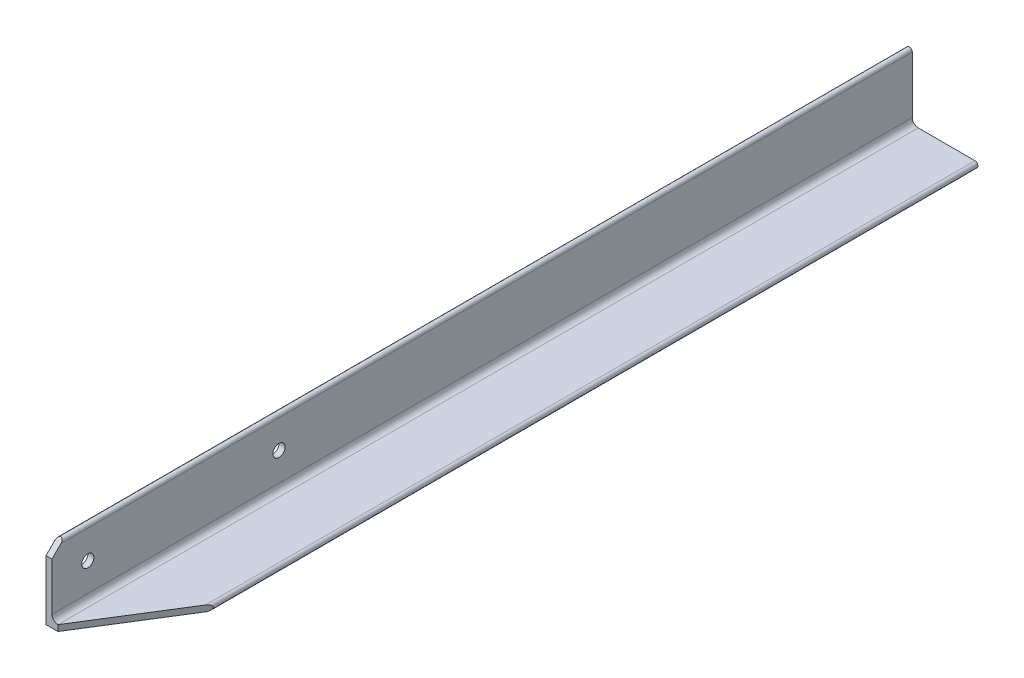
ISO-10303-21;
HEADER;
FILE_DESCRIPTION(('STEP AP214'),'2;1');
FILE_NAME('part.step','',(''),(''),'','','');
FILE_SCHEMA(('AUTOMOTIVE_DESIGN { 1 0 10303 214 1 1 1 1 }'));
ENDSEC;
DATA;
#1=APPLICATION_CONTEXT('core data for automotive mechanical design processes');
#2=APPLICATION_PROTOCOL_DEFINITION('international standard','automotive_design',2000,#1);
#3=PRODUCT_CONTEXT('',#1,'mechanical');
#4=PRODUCT('Part','Part','',(#3));
#5=PRODUCT_RELATED_PRODUCT_CATEGORY('part','',(#4));
#6=PRODUCT_DEFINITION_FORMATION('','',#4);
#7=PRODUCT_DEFINITION_CONTEXT('part definition',#1,'design');
#8=PRODUCT_DEFINITION('design','',#6,#7);
#9=PRODUCT_DEFINITION_SHAPE('','',#8);
#10=(LENGTH_UNIT() NAMED_UNIT(*) SI_UNIT(.MILLI.,.METRE.));
#11=(NAMED_UNIT(*) PLANE_ANGLE_UNIT() SI_UNIT($,.RADIAN.));
#12=(NAMED_UNIT(*) SI_UNIT($,.STERADIAN.) SOLID_ANGLE_UNIT());
#13=UNCERTAINTY_MEASURE_WITH_UNIT(LENGTH_MEASURE(1.E-05),#10,'distance_accuracy_value','');
#14=(GEOMETRIC_REPRESENTATION_CONTEXT(3) GLOBAL_UNCERTAINTY_ASSIGNED_CONTEXT((#13)) GLOBAL_UNIT_ASSIGNED_CONTEXT((#10,
#11,#12)) REPRESENTATION_CONTEXT('',''));
#15=CARTESIAN_POINT('',(0.,0.,0.));
#16=DIRECTION('',(0.,0.,1.));
#17=DIRECTION('',(1.,0.,0.));
#18=AXIS2_PLACEMENT_3D('',#15,#16,#17);
#19=CARTESIAN_POINT('',(0.,0.,228.6));
#20=DIRECTION('',(0.,1.,0.));
#21=DIRECTION('',(-1.,0.,0.));
#22=AXIS2_PLACEMENT_3D('',#19,#20,#21);
#23=PLANE('',#22);
#24=DIRECTION('',(0.,0.,-1.));
#25=VECTOR('',#24,1.);
#26=CARTESIAN_POINT('',(36.5125,0.,228.6));
#27=LINE('',#26,#25);
#28=CARTESIAN_POINT('',(36.5125,0.,180.34));
#29=VERTEX_POINT('',#28);
#30=CARTESIAN_POINT('',(36.5125,0.,-228.6));
#31=VERTEX_POINT('',#30);
#32=EDGE_CURVE('E99',#29,#31,#27,.T.);
#33=ORIENTED_EDGE('',*,*,#32,.F.);
#34=DIRECTION('',(0.52999894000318,0.,-0.847998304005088));
#35=VECTOR('',#34,1.);
#36=CARTESIAN_POINT('',(38.1,0.,177.8));
#37=LINE('',#36,#35);
#38=CARTESIAN_POINT('',(6.35,0.,228.6));
#39=VERTEX_POINT('',#38);
#40=EDGE_CURVE('E167',#39,#29,#37,.T.);
#41=ORIENTED_EDGE('',*,*,#40,.F.);
#42=DIRECTION('',(1.,0.,0.));
#43=VECTOR('',#42,1.);
#44=CARTESIAN_POINT('',(0.,0.,228.6));
#45=LINE('',#44,#43);
#46=CARTESIAN_POINT('',(0.,0.,228.6));
#47=VERTEX_POINT('',#46);
#48=EDGE_CURVE('E172',#47,#39,#45,.T.);
#49=ORIENTED_EDGE('',*,*,#48,.F.);
#50=DIRECTION('',(0.,0.,-1.));
#51=VECTOR('',#50,1.);
#52=CARTESIAN_POINT('',(0.,0.,228.6));
#53=LINE('',#52,#51);
#54=CARTESIAN_POINT('',(0.,0.,-228.6));
#55=VERTEX_POINT('',#54);
#56=EDGE_CURVE('E189',#47,#55,#53,.T.);
#57=ORIENTED_EDGE('',*,*,#56,.T.);
#58=DIRECTION('',(1.,0.,0.));
#59=VECTOR('',#58,1.);
#60=CARTESIAN_POINT('',(0.,0.,-228.6));
#61=LINE('',#60,#59);
#62=EDGE_CURVE('E190',#55,#31,#61,.T.);
#63=ORIENTED_EDGE('',*,*,#62,.T.);
#64=EDGE_LOOP('',(#33,#41,#49,#57,#63));
#65=FACE_BOUND('',#64,.T.);
#66=ADVANCED_FACE('F92',(#65),#23,.F.);
#67=CARTESIAN_POINT('',(36.5125,1.5875,228.6));
#68=DIRECTION('',(0.,0.,-1.));
#69=DIRECTION('',(-1.,0.,0.));
#70=AXIS2_PLACEMENT_3D('',#67,#68,#69);
#71=CYLINDRICAL_SURFACE('',#70,1.5875);
#72=CARTESIAN_POINT('',(36.5125,1.5875,180.34));
#73=DIRECTION('',(-0.847998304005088,0.,-0.52999894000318));
#74=DIRECTION('',(0.52999894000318,0.,-0.847998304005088));
#75=AXIS2_PLACEMENT_3D('',#72,#73,#74);
#76=ELLIPSE('',#75,2.99528900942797,1.5875);
#77=CARTESIAN_POINT('',(36.5125,3.175,180.34));
#78=VERTEX_POINT('',#77);
#79=EDGE_CURVE('E228',#78,#29,#76,.T.);
#80=ORIENTED_EDGE('',*,*,#79,.T.);
#81=ORIENTED_EDGE('',*,*,#32,.T.);
#82=CARTESIAN_POINT('',(36.5125,1.5875,-228.6));
#83=DIRECTION('',(0.,0.,1.));
#84=DIRECTION('',(1.,0.,0.));
#85=AXIS2_PLACEMENT_3D('',#82,#83,#84);
#86=CIRCLE('',#85,1.5875);
#87=CARTESIAN_POINT('',(36.5125,3.175,-228.6));
#88=VERTEX_POINT('',#87);
#89=EDGE_CURVE('E192',#31,#88,#86,.T.);
#90=ORIENTED_EDGE('',*,*,#89,.T.);
#91=DIRECTION('',(0.,0.,-1.));
#92=VECTOR('',#91,1.);
#93=CARTESIAN_POINT('',(36.5125,3.175,228.6));
#94=LINE('',#93,#92);
#95=EDGE_CURVE('E220',#78,#88,#94,.T.);
#96=ORIENTED_EDGE('',*,*,#95,.F.);
#97=EDGE_LOOP('',(#80,#81,#90,#96));
#98=FACE_BOUND('',#97,.T.);
#99=ADVANCED_FACE('F225',(#98),#71,.T.);
#100=CARTESIAN_POINT('',(6.35000000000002,3.175,228.6));
#101=DIRECTION('',(0.,-1.,0.));
#102=DIRECTION('',(0.,0.,-1.));
#103=AXIS2_PLACEMENT_3D('',#100,#101,#102);
#104=PLANE('',#103);
#105=DIRECTION('',(0.,0.,-1.));
#106=VECTOR('',#105,1.);
#107=CARTESIAN_POINT('',(6.35000000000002,3.175,228.6));
#108=LINE('',#107,#106);
#109=CARTESIAN_POINT('',(6.35000000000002,3.175,228.6));
#110=VERTEX_POINT('',#109);
#111=CARTESIAN_POINT('',(6.35000000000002,3.175,-228.6));
#112=VERTEX_POINT('',#111);
#113=EDGE_CURVE('E216',#110,#112,#108,.T.);
#114=ORIENTED_EDGE('',*,*,#113,.F.);
#115=DIRECTION('',(0.52999894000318,0.,-0.847998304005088));
#116=VECTOR('',#115,1.);
#117=CARTESIAN_POINT('',(6.35,3.175,228.6));
#118=LINE('',#117,#116);
#119=EDGE_CURVE('E149',#110,#78,#118,.T.);
#120=ORIENTED_EDGE('',*,*,#119,.T.);
#121=ORIENTED_EDGE('',*,*,#95,.T.);
#122=DIRECTION('',(-1.,0.,0.));
#123=VECTOR('',#122,1.);
#124=CARTESIAN_POINT('',(6.35000000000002,3.175,-228.6));
#125=LINE('',#124,#123);
#126=EDGE_CURVE('E195',#88,#112,#125,.T.);
#127=ORIENTED_EDGE('',*,*,#126,.T.);
#128=EDGE_LOOP('',(#114,#120,#121,#127));
#129=FACE_BOUND('',#128,.T.);
#130=ADVANCED_FACE('F253',(#129),#104,.F.);
#131=CARTESIAN_POINT('',(6.35,6.35,228.6));
#132=DIRECTION('',(0.,0.,-1.));
#133=DIRECTION('',(-1.,0.,0.));
#134=AXIS2_PLACEMENT_3D('',#131,#132,#133);
#135=CYLINDRICAL_SURFACE('',#134,3.175);
#136=CARTESIAN_POINT('',(6.35,6.35,-228.6));
#137=DIRECTION('',(0.,0.,-1.));
#138=DIRECTION('',(1.,0.,0.));
#139=AXIS2_PLACEMENT_3D('',#136,#137,#138);
#140=CIRCLE('',#139,3.175);
#141=CARTESIAN_POINT('',(3.175,6.35000000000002,-228.6));
#142=VERTEX_POINT('',#141);
#143=EDGE_CURVE('E197',#112,#142,#140,.T.);
#144=ORIENTED_EDGE('',*,*,#143,.T.);
#145=DIRECTION('',(0.,0.,-1.));
#146=VECTOR('',#145,1.);
#147=CARTESIAN_POINT('',(3.175,6.35000000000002,228.6));
#148=LINE('',#147,#146);
#149=CARTESIAN_POINT('',(3.175,6.35000000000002,228.6));
#150=VERTEX_POINT('',#149);
#151=EDGE_CURVE('E212',#150,#142,#148,.T.);
#152=ORIENTED_EDGE('',*,*,#151,.F.);
#153=CARTESIAN_POINT('',(6.35,6.35,228.6));
#154=DIRECTION('',(0.,0.,-1.));
#155=DIRECTION('',(1.,0.,0.));
#156=AXIS2_PLACEMENT_3D('',#153,#154,#155);
#157=CIRCLE('',#156,3.175);
#158=EDGE_CURVE('E176',#110,#150,#157,.T.);
#159=ORIENTED_EDGE('',*,*,#158,.F.);
#160=ORIENTED_EDGE('',*,*,#113,.T.);
#161=EDGE_LOOP('',(#144,#152,#159,#160));
#162=FACE_BOUND('',#161,.T.);
#163=ADVANCED_FACE('F251',(#162),#135,.F.);
#164=CARTESIAN_POINT('',(3.175,6.35000000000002,228.6));
#165=DIRECTION('',(-1.,0.,0.));
#166=DIRECTION('',(0.,0.,1.));
#167=AXIS2_PLACEMENT_3D('',#164,#165,#166);
#168=PLANE('',#167);
#169=CARTESIAN_POINT('',(3.175,21.43125,209.55));
#170=DIRECTION('',(1.,0.,0.));
#171=DIRECTION('',(0.,0.,-1.));
#172=AXIS2_PLACEMENT_3D('',#169,#170,#171);
#173=CIRCLE('',#172,3.23850000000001);
#174=CARTESIAN_POINT('',(3.175,21.43125,206.3115));
#175=VERTEX_POINT('',#174);
#176=EDGE_CURVE('E261',#175,#175,#173,.T.);
#177=ORIENTED_EDGE('',*,*,#176,.F.);
#178=EDGE_LOOP('',(#177));
#179=FACE_BOUND('',#178,.T.);
#180=CARTESIAN_POINT('',(3.175,21.43125,107.95));
#181=DIRECTION('',(1.,0.,0.));
#182=DIRECTION('',(0.,0.,-1.));
#183=AXIS2_PLACEMENT_3D('',#180,#181,#182);
#184=CIRCLE('',#183,3.23850000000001);
#185=CARTESIAN_POINT('',(3.175,21.43125,104.7115));
#186=VERTEX_POINT('',#185);
#187=EDGE_CURVE('E255',#186,#186,#184,.T.);
#188=ORIENTED_EDGE('',*,*,#187,.F.);
#189=EDGE_LOOP('',(#188));
#190=FACE_BOUND('',#189,.T.);
#191=DIRECTION('',(0.,0.,-1.));
#192=VECTOR('',#191,1.);
#193=CARTESIAN_POINT('',(3.175,36.5125,228.6));
#194=LINE('',#193,#192);
#195=CARTESIAN_POINT('',(3.175,36.5125,223.8375));
#196=VERTEX_POINT('',#195);
#197=CARTESIAN_POINT('',(3.175,36.5125,-228.6));
#198=VERTEX_POINT('',#197);
#199=EDGE_CURVE('E209',#196,#198,#194,.T.);
#200=ORIENTED_EDGE('',*,*,#199,.F.);
#201=DIRECTION('',(0.,0.707106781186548,-0.707106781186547));
#202=VECTOR('',#201,1.);
#203=CARTESIAN_POINT('',(3.175,31.75,228.6));
#204=LINE('',#203,#202);
#205=CARTESIAN_POINT('',(3.175,31.75,228.6));
#206=VERTEX_POINT('',#205);
#207=EDGE_CURVE('E236',#206,#196,#204,.T.);
#208=ORIENTED_EDGE('',*,*,#207,.F.);
#209=DIRECTION('',(0.,1.,0.));
#210=VECTOR('',#209,1.);
#211=CARTESIAN_POINT('',(3.175,6.35000000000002,228.6));
#212=LINE('',#211,#210);
#213=EDGE_CURVE('E178',#150,#206,#212,.T.);
#214=ORIENTED_EDGE('',*,*,#213,.F.);
#215=ORIENTED_EDGE('',*,*,#151,.T.);
#216=DIRECTION('',(0.,1.,0.));
#217=VECTOR('',#216,1.);
#218=CARTESIAN_POINT('',(3.175,6.35000000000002,-228.6));
#219=LINE('',#218,#217);
#220=EDGE_CURVE('E199',#142,#198,#219,.T.);
#221=ORIENTED_EDGE('',*,*,#220,.T.);
#222=EDGE_LOOP('',(#200,#208,#214,#215,#221));
#223=FACE_BOUND('',#222,.T.);
#224=ADVANCED_FACE('F245',(#179,#190,#223),#168,.F.);
#225=CARTESIAN_POINT('',(1.5875,36.5125,228.6));
#226=DIRECTION('',(0.,0.,-1.));
#227=DIRECTION('',(-1.,0.,0.));
#228=AXIS2_PLACEMENT_3D('',#225,#226,#227);
#229=CYLINDRICAL_SURFACE('',#228,1.5875);
#230=CARTESIAN_POINT('',(1.5875,36.5125,223.8375));
#231=DIRECTION('',(0.,-0.707106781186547,-0.707106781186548));
#232=DIRECTION('',(0.,0.707106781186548,-0.707106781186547));
#233=AXIS2_PLACEMENT_3D('',#230,#231,#232);
#234=ELLIPSE('',#233,2.24506403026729,1.5875);
#235=CARTESIAN_POINT('',(0.,36.5125,223.8375));
#236=VERTEX_POINT('',#235);
#237=EDGE_CURVE('E183',#236,#196,#234,.T.);
#238=ORIENTED_EDGE('',*,*,#237,.T.);
#239=ORIENTED_EDGE('',*,*,#199,.T.);
#240=CARTESIAN_POINT('',(1.5875,36.5125,-228.6));
#241=DIRECTION('',(0.,0.,1.));
#242=DIRECTION('',(1.,0.,0.));
#243=AXIS2_PLACEMENT_3D('',#240,#241,#242);
#244=CIRCLE('',#243,1.5875);
#245=CARTESIAN_POINT('',(0.,36.5125,-228.6));
#246=VERTEX_POINT('',#245);
#247=EDGE_CURVE('E180',#198,#246,#244,.T.);
#248=ORIENTED_EDGE('',*,*,#247,.T.);
#249=DIRECTION('',(0.,0.,-1.));
#250=VECTOR('',#249,1.);
#251=CARTESIAN_POINT('',(0.,36.5125,228.6));
#252=LINE('',#251,#250);
#253=EDGE_CURVE('E206',#236,#246,#252,.T.);
#254=ORIENTED_EDGE('',*,*,#253,.F.);
#255=EDGE_LOOP('',(#238,#239,#248,#254));
#256=FACE_BOUND('',#255,.T.);
#257=ADVANCED_FACE('F239',(#256),#229,.T.);
#258=CARTESIAN_POINT('',(0.,0.,228.6));
#259=DIRECTION('',(1.,0.,0.));
#260=DIRECTION('',(0.,1.,0.));
#261=AXIS2_PLACEMENT_3D('',#258,#259,#260);
#262=PLANE('',#261);
#263=CARTESIAN_POINT('',(0.,21.43125,209.55));
#264=DIRECTION('',(1.,0.,0.));
#265=DIRECTION('',(0.,0.,-1.));
#266=AXIS2_PLACEMENT_3D('',#263,#264,#265);
#267=CIRCLE('',#266,3.23850000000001);
#268=CARTESIAN_POINT('',(0.,21.43125,206.3115));
#269=VERTEX_POINT('',#268);
#270=EDGE_CURVE('E258',#269,#269,#267,.T.);
#271=ORIENTED_EDGE('',*,*,#270,.T.);
#272=EDGE_LOOP('',(#271));
#273=FACE_BOUND('',#272,.T.);
#274=CARTESIAN_POINT('',(0.,21.43125,107.95));
#275=DIRECTION('',(1.,0.,0.));
#276=DIRECTION('',(0.,0.,-1.));
#277=AXIS2_PLACEMENT_3D('',#274,#275,#276);
#278=CIRCLE('',#277,3.23850000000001);
#279=CARTESIAN_POINT('',(0.,21.43125,104.7115));
#280=VERTEX_POINT('',#279);
#281=EDGE_CURVE('E264',#280,#280,#278,.T.);
#282=ORIENTED_EDGE('',*,*,#281,.T.);
#283=EDGE_LOOP('',(#282));
#284=FACE_BOUND('',#283,.T.);
#285=DIRECTION('',(0.,-1.,0.));
#286=VECTOR('',#285,1.);
#287=CARTESIAN_POINT('',(0.,0.,228.6));
#288=LINE('',#287,#286);
#289=CARTESIAN_POINT('',(0.,31.75,228.6));
#290=VERTEX_POINT('',#289);
#291=EDGE_CURVE('E114',#290,#47,#288,.T.);
#292=ORIENTED_EDGE('',*,*,#291,.F.);
#293=DIRECTION('',(0.,0.707106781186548,-0.707106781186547));
#294=VECTOR('',#293,1.);
#295=CARTESIAN_POINT('',(0.,31.75,228.6));
#296=LINE('',#295,#294);
#297=EDGE_CURVE('E106',#290,#236,#296,.T.);
#298=ORIENTED_EDGE('',*,*,#297,.T.);
#299=ORIENTED_EDGE('',*,*,#253,.T.);
#300=DIRECTION('',(0.,-1.,0.));
#301=VECTOR('',#300,1.);
#302=CARTESIAN_POINT('',(0.,0.,-228.6));
#303=LINE('',#302,#301);
#304=EDGE_CURVE('E143',#246,#55,#303,.T.);
#305=ORIENTED_EDGE('',*,*,#304,.T.);
#306=ORIENTED_EDGE('',*,*,#56,.F.);
#307=EDGE_LOOP('',(#292,#298,#299,#305,#306));
#308=FACE_BOUND('',#307,.T.);
#309=ADVANCED_FACE('F233',(#273,#284,#308),#262,.F.);
#310=CARTESIAN_POINT('',(36.5125,1.5875,228.6));
#311=DIRECTION('',(0.,0.,1.));
#312=DIRECTION('',(1.,0.,0.));
#313=AXIS2_PLACEMENT_3D('',#310,#311,#312);
#314=PLANE('',#313);
#315=DIRECTION('',(0.,-1.,0.));
#316=VECTOR('',#315,1.);
#317=CARTESIAN_POINT('',(6.35,1.5875,228.6));
#318=LINE('',#317,#316);
#319=EDGE_CURVE('E14',#110,#39,#318,.T.);
#320=ORIENTED_EDGE('',*,*,#319,.F.);
#321=ORIENTED_EDGE('',*,*,#158,.T.);
#322=ORIENTED_EDGE('',*,*,#213,.T.);
#323=DIRECTION('',(1.,0.,0.));
#324=VECTOR('',#323,1.);
#325=CARTESIAN_POINT('',(0.,31.75,228.6));
#326=LINE('',#325,#324);
#327=EDGE_CURVE('E235',#290,#206,#326,.T.);
#328=ORIENTED_EDGE('',*,*,#327,.F.);
#329=ORIENTED_EDGE('',*,*,#291,.T.);
#330=ORIENTED_EDGE('',*,*,#48,.T.);
#331=EDGE_LOOP('',(#320,#321,#322,#328,#329,#330));
#332=FACE_BOUND('',#331,.T.);
#333=ADVANCED_FACE('F175',(#332),#314,.T.);
#334=CARTESIAN_POINT('',(36.5125,1.5875,-228.6));
#335=DIRECTION('',(0.,0.,1.));
#336=DIRECTION('',(1.,0.,0.));
#337=AXIS2_PLACEMENT_3D('',#334,#335,#336);
#338=PLANE('',#337);
#339=ORIENTED_EDGE('',*,*,#62,.F.);
#340=ORIENTED_EDGE('',*,*,#304,.F.);
#341=ORIENTED_EDGE('',*,*,#247,.F.);
#342=ORIENTED_EDGE('',*,*,#220,.F.);
#343=ORIENTED_EDGE('',*,*,#143,.F.);
#344=ORIENTED_EDGE('',*,*,#126,.F.);
#345=ORIENTED_EDGE('',*,*,#89,.F.);
#346=EDGE_LOOP('',(#339,#340,#341,#342,#343,#344,#345));
#347=FACE_BOUND('',#346,.T.);
#348=ADVANCED_FACE('F231',(#347),#338,.F.);
#349=CARTESIAN_POINT('',(0.,31.75,228.6));
#350=DIRECTION('',(0.,-0.707106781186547,-0.707106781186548));
#351=DIRECTION('',(0.,0.707106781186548,-0.707106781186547));
#352=AXIS2_PLACEMENT_3D('',#349,#350,#351);
#353=PLANE('',#352);
#354=ORIENTED_EDGE('',*,*,#237,.F.);
#355=ORIENTED_EDGE('',*,*,#297,.F.);
#356=ORIENTED_EDGE('',*,*,#327,.T.);
#357=ORIENTED_EDGE('',*,*,#207,.T.);
#358=EDGE_LOOP('',(#354,#355,#356,#357));
#359=FACE_BOUND('',#358,.T.);
#360=ADVANCED_FACE('F269',(#359),#353,.F.);
#361=CARTESIAN_POINT('',(0.,21.43125,107.95));
#362=DIRECTION('',(1.,0.,0.));
#363=DIRECTION('',(0.,0.,-1.));
#364=AXIS2_PLACEMENT_3D('',#361,#362,#363);
#365=CYLINDRICAL_SURFACE('',#364,3.23850000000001);
#366=ORIENTED_EDGE('',*,*,#281,.F.);
#367=EDGE_LOOP('',(#366));
#368=FACE_BOUND('',#367,.T.);
#369=ORIENTED_EDGE('',*,*,#187,.T.);
#370=EDGE_LOOP('',(#369));
#371=FACE_BOUND('',#370,.T.);
#372=ADVANCED_FACE('F271',(#368,#371),#365,.F.);
#373=CARTESIAN_POINT('',(0.,21.43125,209.55));
#374=DIRECTION('',(1.,0.,0.));
#375=DIRECTION('',(0.,0.,-1.));
#376=AXIS2_PLACEMENT_3D('',#373,#374,#375);
#377=CYLINDRICAL_SURFACE('',#376,3.23850000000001);
#378=ORIENTED_EDGE('',*,*,#270,.F.);
#379=EDGE_LOOP('',(#378));
#380=FACE_BOUND('',#379,.T.);
#381=ORIENTED_EDGE('',*,*,#176,.T.);
#382=EDGE_LOOP('',(#381));
#383=FACE_BOUND('',#382,.T.);
#384=ADVANCED_FACE('F277',(#380,#383),#377,.F.);
#385=CARTESIAN_POINT('',(38.1,38.1,177.8));
#386=DIRECTION('',(-0.847998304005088,0.,-0.52999894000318));
#387=DIRECTION('',(-0.52999894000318,0.,0.847998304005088));
#388=AXIS2_PLACEMENT_3D('',#385,#386,#387);
#389=PLANE('',#388);
#390=ORIENTED_EDGE('',*,*,#79,.F.);
#391=ORIENTED_EDGE('',*,*,#119,.F.);
#392=ORIENTED_EDGE('',*,*,#319,.T.);
#393=ORIENTED_EDGE('',*,*,#40,.T.);
#394=EDGE_LOOP('',(#390,#391,#392,#393));
#395=FACE_BOUND('',#394,.T.);
#396=ADVANCED_FACE('F166',(#395),#389,.F.);
#397=CLOSED_SHELL('',(#66,#99,#130,#163,#224,#257,#309,#333,#348,#360,#372,#384,#396));
#398=MANIFOLD_SOLID_BREP('B2',#397);
#399=ADVANCED_BREP_SHAPE_REPRESENTATION('',(#18,#398),#14);
#400=SHAPE_DEFINITION_REPRESENTATION(#9,#399);
ENDSEC;
END-ISO-10303-21;
